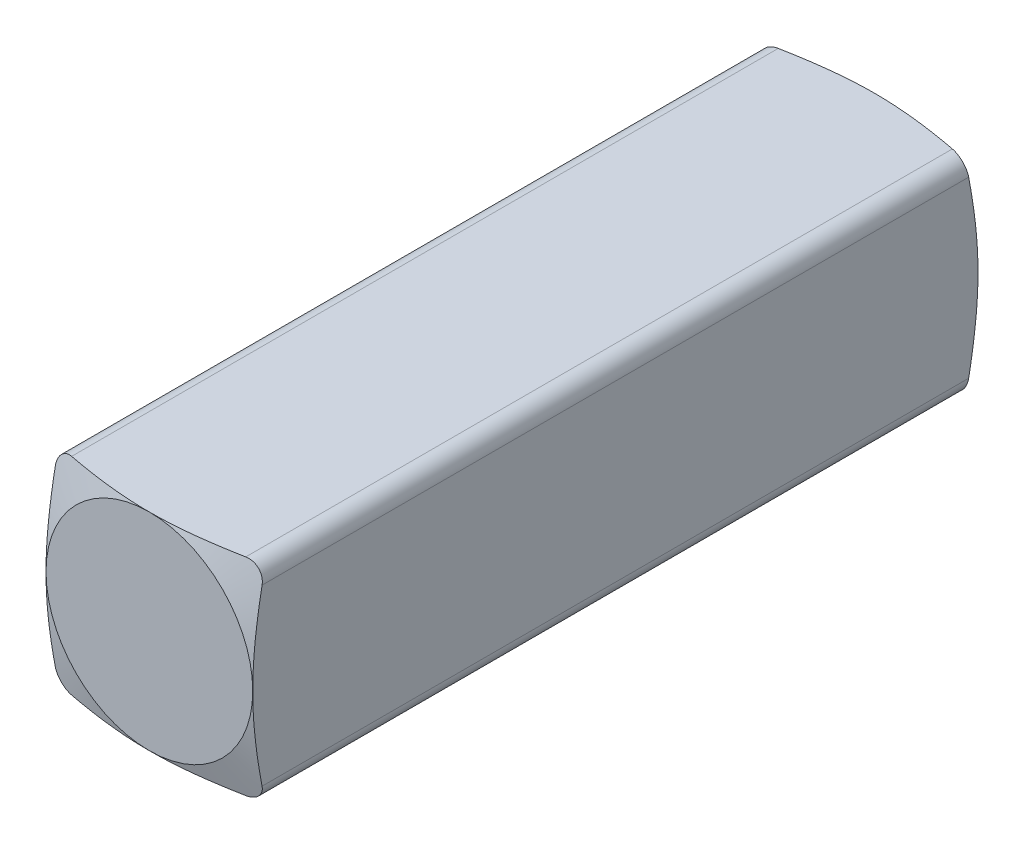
from build123d import *

# Parameters (mm, degrees)
SKETCH1_W      = 3.17
SKETCH1_H      = 3.17
EXTRUDE1_DEPTH = 5.56
FILLET1_R      = 0.25


with BuildPart() as part:
    # Sketch1 → Extrude1 (new, symmetric)
    with BuildSketch(Plane.XY):
        with Locations((0.050122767, 0)):
            Rectangle(SKETCH1_W, SKETCH1_H)
    extrude(amount=EXTRUDE1_DEPTH, both=True)

    # Sketch4 → Cut-Revolve3 (revolve, cut)
    with BuildSketch(Plane.XZ):
        Polygon((1.635122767, 5.56), (2.555122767, 5.56), (2.555122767, 5.29), align=None)
    cut_revolve3 = revolve(axis=Axis((0.050122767, 0, -5.56), (0, 0, 1)), mode=Mode.SUBTRACT)

    # Mirror2: Cut-Revolve3 across plane
    add(cut_revolve3.mirror(Plane.XY), mode=Mode.SUBTRACT)

    # Fillet1
    fillet1_edges = [part.edges().sort_by_distance(p)[0] for p in [
        (1.635122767, 1.585, 0),
        (1.635122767, -1.585, 0),
        (-1.534877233, -1.585, 0),
        (-1.534877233, 1.585, 0),
    ]]
    fillet(fillet1_edges, radius=FILLET1_R)


solid = part.part
